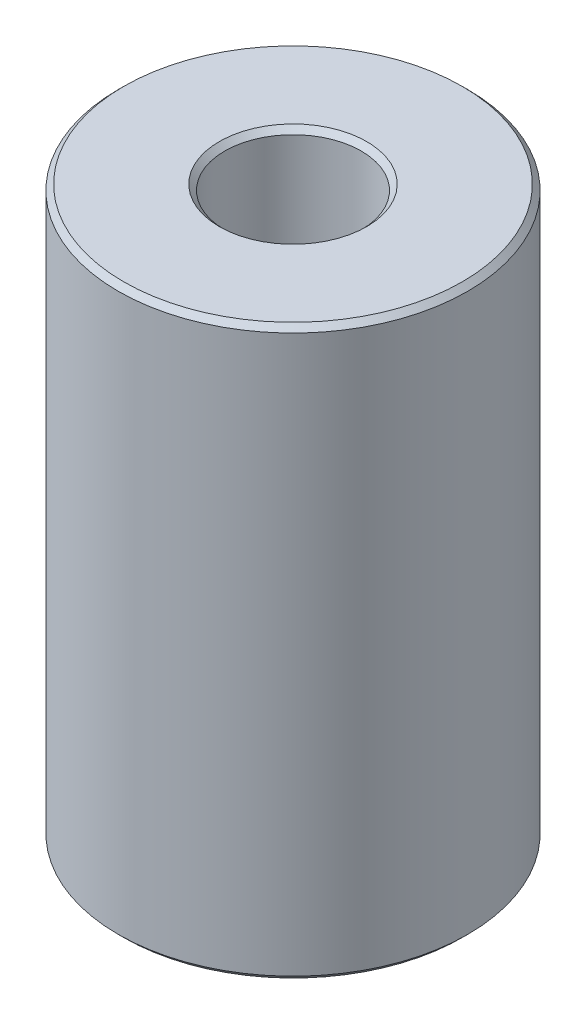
ISO-10303-21;
HEADER;
FILE_DESCRIPTION(('STEP AP214'),'2;1');
FILE_NAME('part.step','',(''),(''),'','','');
FILE_SCHEMA(('AUTOMOTIVE_DESIGN { 1 0 10303 214 1 1 1 1 }'));
ENDSEC;
DATA;
#1=APPLICATION_CONTEXT('core data for automotive mechanical design processes');
#2=APPLICATION_PROTOCOL_DEFINITION('international standard','automotive_design',2000,#1);
#3=PRODUCT_CONTEXT('',#1,'mechanical');
#4=PRODUCT('Part','Part','',(#3));
#5=PRODUCT_RELATED_PRODUCT_CATEGORY('part','',(#4));
#6=PRODUCT_DEFINITION_FORMATION('','',#4);
#7=PRODUCT_DEFINITION_CONTEXT('part definition',#1,'design');
#8=PRODUCT_DEFINITION('design','',#6,#7);
#9=PRODUCT_DEFINITION_SHAPE('','',#8);
#10=(LENGTH_UNIT() NAMED_UNIT(*) SI_UNIT(.MILLI.,.METRE.));
#11=(NAMED_UNIT(*) PLANE_ANGLE_UNIT() SI_UNIT($,.RADIAN.));
#12=(NAMED_UNIT(*) SI_UNIT($,.STERADIAN.) SOLID_ANGLE_UNIT());
#13=UNCERTAINTY_MEASURE_WITH_UNIT(LENGTH_MEASURE(1.E-05),#10,'distance_accuracy_value','');
#14=(GEOMETRIC_REPRESENTATION_CONTEXT(3) GLOBAL_UNCERTAINTY_ASSIGNED_CONTEXT((#13)) GLOBAL_UNIT_ASSIGNED_CONTEXT((#10,
#11,#12)) REPRESENTATION_CONTEXT('',''));
#15=CARTESIAN_POINT('',(0.,0.,0.));
#16=DIRECTION('',(0.,0.,1.));
#17=DIRECTION('',(1.,0.,0.));
#18=AXIS2_PLACEMENT_3D('',#15,#16,#17);
#19=CARTESIAN_POINT('',(0.,52.,0.));
#20=DIRECTION('',(0.,1.,0.));
#21=DIRECTION('',(0.,0.,1.));
#22=AXIS2_PLACEMENT_3D('',#19,#20,#21);
#23=PLANE('',#22);
#24=CARTESIAN_POINT('',(0.,52.,0.));
#25=DIRECTION('',(0.,1.,0.));
#26=DIRECTION('',(0.,0.,1.));
#27=AXIS2_PLACEMENT_3D('',#24,#25,#26);
#28=CIRCLE('',#27,6.75000000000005);
#29=CARTESIAN_POINT('',(0.,52.,6.75000000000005));
#30=VERTEX_POINT('',#29);
#31=EDGE_CURVE('E10',#30,#30,#28,.F.);
#32=ORIENTED_EDGE('',*,*,#31,.T.);
#33=EDGE_LOOP('',(#32));
#34=FACE_BOUND('',#33,.T.);
#35=CARTESIAN_POINT('',(0.,52.,0.));
#36=DIRECTION('',(0.,1.,0.));
#37=DIRECTION('',(0.,0.,1.));
#38=AXIS2_PLACEMENT_3D('',#35,#36,#37);
#39=CIRCLE('',#38,15.5);
#40=CARTESIAN_POINT('',(0.,52.,15.5));
#41=VERTEX_POINT('',#40);
#42=EDGE_CURVE('E37',#41,#41,#39,.T.);
#43=ORIENTED_EDGE('',*,*,#42,.T.);
#44=EDGE_LOOP('',(#43));
#45=FACE_BOUND('',#44,.T.);
#46=ADVANCED_FACE('F30',(#34,#45),#23,.T.);
#47=CARTESIAN_POINT('',(0.,0.,0.));
#48=DIRECTION('',(0.,1.,0.));
#49=DIRECTION('',(0.,0.,1.));
#50=AXIS2_PLACEMENT_3D('',#47,#48,#49);
#51=PLANE('',#50);
#52=CARTESIAN_POINT('',(0.,0.,0.));
#53=DIRECTION('',(0.,1.,0.));
#54=DIRECTION('',(0.,0.,1.));
#55=AXIS2_PLACEMENT_3D('',#52,#53,#54);
#56=CIRCLE('',#55,6.74999999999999);
#57=CARTESIAN_POINT('',(0.,0.,6.74999999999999));
#58=VERTEX_POINT('',#57);
#59=EDGE_CURVE('E56',#58,#58,#56,.T.);
#60=ORIENTED_EDGE('',*,*,#59,.T.);
#61=EDGE_LOOP('',(#60));
#62=FACE_BOUND('',#61,.T.);
#63=CARTESIAN_POINT('',(0.,0.,0.));
#64=DIRECTION('',(0.,1.,0.));
#65=DIRECTION('',(0.,0.,1.));
#66=AXIS2_PLACEMENT_3D('',#63,#64,#65);
#67=CIRCLE('',#66,15.4999999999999);
#68=CARTESIAN_POINT('',(0.,0.,15.4999999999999));
#69=VERTEX_POINT('',#68);
#70=EDGE_CURVE('E59',#69,#69,#67,.F.);
#71=ORIENTED_EDGE('',*,*,#70,.T.);
#72=EDGE_LOOP('',(#71));
#73=FACE_BOUND('',#72,.T.);
#74=ADVANCED_FACE('F63',(#62,#73),#51,.F.);
#75=CARTESIAN_POINT('',(0.,52.,0.));
#76=DIRECTION('',(0.,-1.,0.));
#77=DIRECTION('',(0.,0.,-1.));
#78=AXIS2_PLACEMENT_3D('',#75,#76,#77);
#79=CYLINDRICAL_SURFACE('',#78,16.);
#80=CARTESIAN_POINT('',(0.,0.500000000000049,0.));
#81=DIRECTION('',(0.,1.,0.));
#82=DIRECTION('',(0.,0.,1.));
#83=AXIS2_PLACEMENT_3D('',#80,#81,#82);
#84=CIRCLE('',#83,16.);
#85=CARTESIAN_POINT('',(0.,0.500000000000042,-16.));
#86=VERTEX_POINT('',#85);
#87=EDGE_CURVE('E41',#86,#86,#84,.T.);
#88=CARTESIAN_POINT('',(0.,51.5,0.));
#89=DIRECTION('',(0.,1.,0.));
#90=DIRECTION('',(0.,0.,1.));
#91=AXIS2_PLACEMENT_3D('',#88,#89,#90);
#92=CIRCLE('',#91,16.);
#93=CARTESIAN_POINT('',(0.,51.5,-16.));
#94=VERTEX_POINT('',#93);
#95=EDGE_CURVE('E45',#94,#94,#92,.F.);
#96=CARTESIAN_POINT('',(0.,0.500000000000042,-16.));
#97=CARTESIAN_POINT('',(0.,1.03125000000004,-16.));
#98=CARTESIAN_POINT('',(0.,1.56250000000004,-16.));
#99=CARTESIAN_POINT('',(0.,2.62500000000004,-16.));
#100=CARTESIAN_POINT('',(0.,3.15625000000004,-16.));
#101=CARTESIAN_POINT('',(0.,4.21875000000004,-16.));
#102=CARTESIAN_POINT('',(0.,4.75000000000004,-16.));
#103=CARTESIAN_POINT('',(0.,5.81250000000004,-16.));
#104=CARTESIAN_POINT('',(0.,6.34375000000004,-16.));
#105=CARTESIAN_POINT('',(0.,7.40625000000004,-16.));
#106=CARTESIAN_POINT('',(0.,7.93750000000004,-16.));
#107=CARTESIAN_POINT('',(0.,9.00000000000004,-16.));
#108=CARTESIAN_POINT('',(0.,9.53125000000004,-16.));
#109=CARTESIAN_POINT('',(0.,10.59375,-16.));
#110=CARTESIAN_POINT('',(0.,11.125,-16.));
#111=CARTESIAN_POINT('',(0.,12.1875,-16.));
#112=CARTESIAN_POINT('',(0.,12.71875,-16.));
#113=CARTESIAN_POINT('',(0.,13.78125,-16.));
#114=CARTESIAN_POINT('',(0.,14.3125,-16.));
#115=CARTESIAN_POINT('',(0.,15.375,-16.));
#116=CARTESIAN_POINT('',(0.,15.90625,-16.));
#117=CARTESIAN_POINT('',(0.,16.96875,-16.));
#118=CARTESIAN_POINT('',(0.,17.5,-16.));
#119=CARTESIAN_POINT('',(0.,18.5625,-16.));
#120=CARTESIAN_POINT('',(0.,19.09375,-16.));
#121=CARTESIAN_POINT('',(0.,20.15625,-16.));
#122=CARTESIAN_POINT('',(0.,20.6875,-16.));
#123=CARTESIAN_POINT('',(0.,21.75,-16.));
#124=CARTESIAN_POINT('',(0.,22.28125,-16.));
#125=CARTESIAN_POINT('',(0.,23.34375,-16.));
#126=CARTESIAN_POINT('',(0.,23.875,-16.));
#127=CARTESIAN_POINT('',(0.,24.9375,-16.));
#128=CARTESIAN_POINT('',(0.,25.46875,-16.));
#129=CARTESIAN_POINT('',(0.,26.53125,-16.));
#130=CARTESIAN_POINT('',(0.,27.0625,-16.));
#131=CARTESIAN_POINT('',(0.,28.125,-16.));
#132=CARTESIAN_POINT('',(0.,28.65625,-16.));
#133=CARTESIAN_POINT('',(0.,29.71875,-16.));
#134=CARTESIAN_POINT('',(0.,30.25,-16.));
#135=CARTESIAN_POINT('',(0.,31.3125,-16.));
#136=CARTESIAN_POINT('',(0.,31.84375,-16.));
#137=CARTESIAN_POINT('',(0.,32.90625,-16.));
#138=CARTESIAN_POINT('',(0.,33.4375,-16.));
#139=CARTESIAN_POINT('',(0.,34.5,-16.));
#140=CARTESIAN_POINT('',(0.,35.03125,-16.));
#141=CARTESIAN_POINT('',(0.,36.09375,-16.));
#142=CARTESIAN_POINT('',(0.,36.625,-16.));
#143=CARTESIAN_POINT('',(0.,37.6875,-16.));
#144=CARTESIAN_POINT('',(0.,38.21875,-16.));
#145=CARTESIAN_POINT('',(0.,39.28125,-16.));
#146=CARTESIAN_POINT('',(0.,39.8125,-16.));
#147=CARTESIAN_POINT('',(0.,40.875,-16.));
#148=CARTESIAN_POINT('',(0.,41.40625,-16.));
#149=CARTESIAN_POINT('',(0.,42.46875,-16.));
#150=CARTESIAN_POINT('',(0.,43.,-16.));
#151=CARTESIAN_POINT('',(0.,44.0625,-16.));
#152=CARTESIAN_POINT('',(0.,44.59375,-16.));
#153=CARTESIAN_POINT('',(0.,45.65625,-16.));
#154=CARTESIAN_POINT('',(0.,46.1875,-16.));
#155=CARTESIAN_POINT('',(0.,47.25,-16.));
#156=CARTESIAN_POINT('',(0.,47.78125,-16.));
#157=CARTESIAN_POINT('',(0.,48.84375,-16.));
#158=CARTESIAN_POINT('',(0.,49.375,-16.));
#159=CARTESIAN_POINT('',(0.,50.4375,-16.));
#160=CARTESIAN_POINT('',(0.,50.96875,-16.));
#161=CARTESIAN_POINT('',(0.,51.5,-16.));
#162=B_SPLINE_CURVE_WITH_KNOTS('',3,(#96,#97,#98,#99,#100,#101,#102,#103,#104,#105,#106,#107,
#108,#109,#110,#111,#112,#113,#114,#115,#116,#117,#118,#119,#120,#121,#122,#123,#124,#125,#126,
#127,#128,#129,#130,#131,#132,#133,#134,#135,#136,#137,#138,#139,#140,#141,#142,#143,#144,#145,
#146,#147,#148,#149,#150,#151,#152,#153,#154,#155,#156,#157,#158,#159,#160,#161),.UNSPECIFIED.,
.F.,.F.,(4,2,2,2,2,2,2,2,2,2,2,2,2,2,2,2,2,2,2,2,2,2,2,2,2,2,2,2,2,2,2,2,4),(0.,1.59375,3.1875,
4.78125,6.375,7.96875,9.5625,11.15625,12.75,14.34375,15.9375,17.53125,19.125,20.71875,22.3125,
23.90625,25.5,27.09375,28.6875,30.28125,31.875,33.46875,35.0625,36.65625,38.25,39.84375,41.4375,
43.03125,44.625,46.21875,47.8125,49.40625,51.),.UNSPECIFIED.);
#163=EDGE_CURVE('BSEAM73',#86,#94,#162,.T.);
#164=ORIENTED_EDGE('',*,*,#87,.T.);
#165=ORIENTED_EDGE('',*,*,#95,.T.);
#166=ORIENTED_EDGE('',*,*,#163,.T.);
#167=ORIENTED_EDGE('',*,*,#163,.F.);
#168=EDGE_LOOP('',(#164,#166,#165,#167));
#169=FACE_BOUND('',#168,.T.);
#170=ADVANCED_FACE('F73',(#169),#79,.T.);
#171=CARTESIAN_POINT('',(0.,52.,0.));
#172=DIRECTION('',(0.,-1.,0.));
#173=DIRECTION('',(0.,0.,-1.));
#174=AXIS2_PLACEMENT_3D('',#171,#172,#173);
#175=CYLINDRICAL_SURFACE('',#174,6.25);
#176=CARTESIAN_POINT('',(0.,0.499999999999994,0.));
#177=DIRECTION('',(0.,1.,0.));
#178=DIRECTION('',(0.,0.,1.));
#179=AXIS2_PLACEMENT_3D('',#176,#177,#178);
#180=CIRCLE('',#179,6.25);
#181=CARTESIAN_POINT('',(0.,0.499999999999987,-6.25));
#182=VERTEX_POINT('',#181);
#183=EDGE_CURVE('E50',#182,#182,#180,.F.);
#184=CARTESIAN_POINT('',(0.,51.5,0.));
#185=DIRECTION('',(0.,1.,0.));
#186=DIRECTION('',(0.,0.,1.));
#187=AXIS2_PLACEMENT_3D('',#184,#185,#186);
#188=CIRCLE('',#187,6.25);
#189=CARTESIAN_POINT('',(0.,51.5,-6.25));
#190=VERTEX_POINT('',#189);
#191=EDGE_CURVE('E53',#190,#190,#188,.T.);
#192=CARTESIAN_POINT('',(0.,0.499999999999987,-6.25));
#193=CARTESIAN_POINT('',(0.,1.03124999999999,-6.25));
#194=CARTESIAN_POINT('',(0.,1.56249999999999,-6.25));
#195=CARTESIAN_POINT('',(0.,2.62499999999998,-6.25));
#196=CARTESIAN_POINT('',(0.,3.15624999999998,-6.25));
#197=CARTESIAN_POINT('',(0.,4.21874999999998,-6.25));
#198=CARTESIAN_POINT('',(0.,4.74999999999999,-6.25));
#199=CARTESIAN_POINT('',(0.,5.81249999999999,-6.25));
#200=CARTESIAN_POINT('',(0.,6.34374999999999,-6.25));
#201=CARTESIAN_POINT('',(0.,7.40624999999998,-6.25));
#202=CARTESIAN_POINT('',(0.,7.93749999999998,-6.25));
#203=CARTESIAN_POINT('',(0.,8.99999999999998,-6.25));
#204=CARTESIAN_POINT('',(0.,9.53124999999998,-6.25));
#205=CARTESIAN_POINT('',(0.,10.59375,-6.25));
#206=CARTESIAN_POINT('',(0.,11.125,-6.25));
#207=CARTESIAN_POINT('',(0.,12.1875,-6.25));
#208=CARTESIAN_POINT('',(0.,12.71875,-6.25));
#209=CARTESIAN_POINT('',(0.,13.78125,-6.25));
#210=CARTESIAN_POINT('',(0.,14.3125,-6.25));
#211=CARTESIAN_POINT('',(0.,15.375,-6.25));
#212=CARTESIAN_POINT('',(0.,15.90625,-6.25));
#213=CARTESIAN_POINT('',(0.,16.96875,-6.25));
#214=CARTESIAN_POINT('',(0.,17.5,-6.25));
#215=CARTESIAN_POINT('',(0.,18.5625,-6.25));
#216=CARTESIAN_POINT('',(0.,19.09375,-6.25));
#217=CARTESIAN_POINT('',(0.,20.15625,-6.25));
#218=CARTESIAN_POINT('',(0.,20.6875,-6.25));
#219=CARTESIAN_POINT('',(0.,21.75,-6.25));
#220=CARTESIAN_POINT('',(0.,22.28125,-6.25));
#221=CARTESIAN_POINT('',(0.,23.34375,-6.25));
#222=CARTESIAN_POINT('',(0.,23.875,-6.25));
#223=CARTESIAN_POINT('',(0.,24.9375,-6.25));
#224=CARTESIAN_POINT('',(0.,25.46875,-6.25));
#225=CARTESIAN_POINT('',(0.,26.53125,-6.25));
#226=CARTESIAN_POINT('',(0.,27.0625,-6.25));
#227=CARTESIAN_POINT('',(0.,28.125,-6.25));
#228=CARTESIAN_POINT('',(0.,28.65625,-6.25));
#229=CARTESIAN_POINT('',(0.,29.71875,-6.25));
#230=CARTESIAN_POINT('',(0.,30.25,-6.25));
#231=CARTESIAN_POINT('',(0.,31.3125,-6.25));
#232=CARTESIAN_POINT('',(0.,31.84375,-6.25));
#233=CARTESIAN_POINT('',(0.,32.90625,-6.25));
#234=CARTESIAN_POINT('',(0.,33.4375,-6.25));
#235=CARTESIAN_POINT('',(0.,34.5,-6.25));
#236=CARTESIAN_POINT('',(0.,35.03125,-6.25));
#237=CARTESIAN_POINT('',(0.,36.09375,-6.25));
#238=CARTESIAN_POINT('',(0.,36.625,-6.25));
#239=CARTESIAN_POINT('',(0.,37.6875,-6.25));
#240=CARTESIAN_POINT('',(0.,38.21875,-6.25));
#241=CARTESIAN_POINT('',(0.,39.28125,-6.25));
#242=CARTESIAN_POINT('',(0.,39.8125,-6.25));
#243=CARTESIAN_POINT('',(0.,40.875,-6.25));
#244=CARTESIAN_POINT('',(0.,41.40625,-6.25));
#245=CARTESIAN_POINT('',(0.,42.46875,-6.25));
#246=CARTESIAN_POINT('',(0.,43.,-6.25));
#247=CARTESIAN_POINT('',(0.,44.0625,-6.25));
#248=CARTESIAN_POINT('',(0.,44.59375,-6.25));
#249=CARTESIAN_POINT('',(0.,45.65625,-6.25));
#250=CARTESIAN_POINT('',(0.,46.1875,-6.25));
#251=CARTESIAN_POINT('',(0.,47.25,-6.25));
#252=CARTESIAN_POINT('',(0.,47.78125,-6.25));
#253=CARTESIAN_POINT('',(0.,48.84375,-6.25));
#254=CARTESIAN_POINT('',(0.,49.375,-6.25));
#255=CARTESIAN_POINT('',(0.,50.4375,-6.25));
#256=CARTESIAN_POINT('',(0.,50.96875,-6.25));
#257=CARTESIAN_POINT('',(0.,51.5,-6.25));
#258=B_SPLINE_CURVE_WITH_KNOTS('',3,(#192,#193,#194,#195,#196,#197,#198,#199,#200,#201,#202,
#203,#204,#205,#206,#207,#208,#209,#210,#211,#212,#213,#214,#215,#216,#217,#218,#219,#220,#221,
#222,#223,#224,#225,#226,#227,#228,#229,#230,#231,#232,#233,#234,#235,#236,#237,#238,#239,#240,
#241,#242,#243,#244,#245,#246,#247,#248,#249,#250,#251,#252,#253,#254,#255,#256,#257),
.UNSPECIFIED.,.F.,.F.,(4,2,2,2,2,2,2,2,2,2,2,2,2,2,2,2,2,2,2,2,2,2,2,2,2,2,2,2,2,2,2,2,4),(0.,
1.59375,3.1875,4.78125,6.375,7.96875,9.56249999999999,11.15625,12.75,14.34375,15.9375,17.53125,
19.125,20.71875,22.3125,23.90625,25.5,27.09375,28.6875,30.28125,31.875,33.46875,35.0625,
36.65625,38.25,39.84375,41.4375,43.03125,44.625,46.21875,47.8125,49.40625,51.),.UNSPECIFIED.);
#259=EDGE_CURVE('BSEAM76',#182,#190,#258,.T.);
#260=ORIENTED_EDGE('',*,*,#183,.T.);
#261=ORIENTED_EDGE('',*,*,#191,.T.);
#262=ORIENTED_EDGE('',*,*,#259,.T.);
#263=ORIENTED_EDGE('',*,*,#259,.F.);
#264=EDGE_LOOP('',(#260,#262,#261,#263));
#265=FACE_BOUND('',#264,.T.);
#266=ADVANCED_FACE('F76',(#265),#175,.F.);
#267=CARTESIAN_POINT('',(0.,0.,0.));
#268=DIRECTION('',(0.,-1.,0.));
#269=DIRECTION('',(0.,0.,-1.));
#270=AXIS2_PLACEMENT_3D('',#267,#268,#269);
#271=CONICAL_SURFACE('',#270,6.74999999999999,0.785398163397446);
#272=ORIENTED_EDGE('',*,*,#183,.F.);
#273=EDGE_LOOP('',(#272));
#274=FACE_BOUND('',#273,.T.);
#275=ORIENTED_EDGE('',*,*,#59,.F.);
#276=EDGE_LOOP('',(#275));
#277=FACE_BOUND('',#276,.T.);
#278=ADVANCED_FACE('F69',(#274,#277),#271,.F.);
#279=CARTESIAN_POINT('',(0.,0.500000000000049,0.));
#280=DIRECTION('',(0.,1.,0.));
#281=DIRECTION('',(0.,0.,1.));
#282=AXIS2_PLACEMENT_3D('',#279,#280,#281);
#283=CONICAL_SURFACE('',#282,16.,0.785398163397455);
#284=ORIENTED_EDGE('',*,*,#70,.F.);
#285=EDGE_LOOP('',(#284));
#286=FACE_BOUND('',#285,.T.);
#287=ORIENTED_EDGE('',*,*,#87,.F.);
#288=EDGE_LOOP('',(#287));
#289=FACE_BOUND('',#288,.T.);
#290=ADVANCED_FACE('F65',(#286,#289),#283,.T.);
#291=CARTESIAN_POINT('',(0.,51.5,0.));
#292=DIRECTION('',(0.,1.,0.));
#293=DIRECTION('',(0.,0.,1.));
#294=AXIS2_PLACEMENT_3D('',#291,#292,#293);
#295=CONICAL_SURFACE('',#294,6.25,0.785398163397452);
#296=ORIENTED_EDGE('',*,*,#31,.F.);
#297=EDGE_LOOP('',(#296));
#298=FACE_BOUND('',#297,.T.);
#299=ORIENTED_EDGE('',*,*,#191,.F.);
#300=EDGE_LOOP('',(#299));
#301=FACE_BOUND('',#300,.T.);
#302=ADVANCED_FACE('F68',(#298,#301),#295,.F.);
#303=CARTESIAN_POINT('',(0.,52.,0.));
#304=DIRECTION('',(0.,-1.,0.));
#305=DIRECTION('',(0.,0.,-1.));
#306=AXIS2_PLACEMENT_3D('',#303,#304,#305);
#307=CONICAL_SURFACE('',#306,15.5,0.785398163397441);
#308=ORIENTED_EDGE('',*,*,#95,.F.);
#309=EDGE_LOOP('',(#308));
#310=FACE_BOUND('',#309,.T.);
#311=ORIENTED_EDGE('',*,*,#42,.F.);
#312=EDGE_LOOP('',(#311));
#313=FACE_BOUND('',#312,.T.);
#314=ADVANCED_FACE('F32',(#310,#313),#307,.T.);
#315=CLOSED_SHELL('',(#46,#74,#170,#266,#278,#290,#302,#314));
#316=MANIFOLD_SOLID_BREP('B2',#315);
#317=ADVANCED_BREP_SHAPE_REPRESENTATION('',(#18,#316),#14);
#318=SHAPE_DEFINITION_REPRESENTATION(#9,#317);
ENDSEC;
END-ISO-10303-21;
